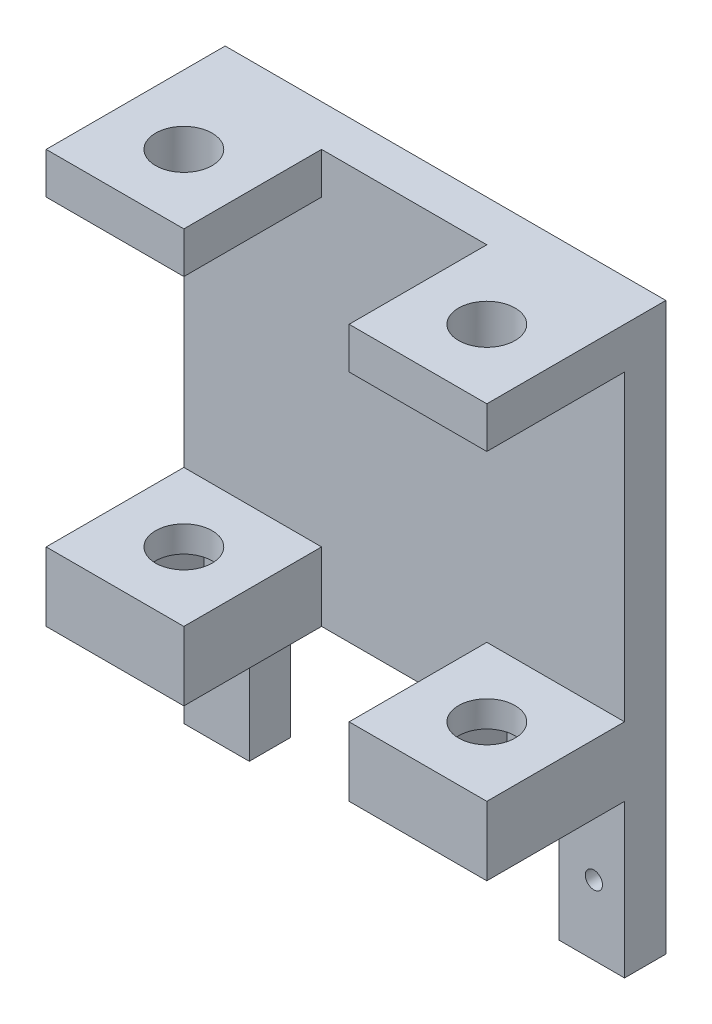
from build123d import *

# Parameters (mm, degrees)
SKETCH1_R             = 1.15
BOSS_EXTRUDE1_DEPTH   = 2.5
BOSS_EXTRUDE1_2_DEPTH = 2.5
BOSS_EXTRUDE1_3_DEPTH = 2.5
BOSS_EXTRUDE1_4_DEPTH = 2.5
BOSS_EXTRUDE1_5_DEPTH = 2.5
SKETCH2_W             = 32
SKETCH2_H             = 30
BOSS_EXTRUDE2_DEPTH   = 3
SKETCH3_W             = 10
SKETCH3_H             = 3
SKETCH3_H_2           = 5
BOSS_EXTRUDE3_DEPTH   = 10
SKETCH4_R             = 2.05
CUT_EXTRUDE1_DEPTH    = 38.366428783
CUT_EXTRUDE2_DEPTH    = 3.1
SKETCH7_W             = 4.75
SKETCH7_H             = 11.11
SKETCH7_R             = 0.625
BOSS_EXTRUDE4_DEPTH   = 3


with BuildPart() as part:
    # Sketch1 → Boss-Extrude1 (new body)
    with BuildSketch(Plane.XY):
        Circle(SKETCH1_R)
    extrude(amount=BOSS_EXTRUDE1_DEPTH)



with BuildPart() as body_2:
    # Sketch1 → Boss-Extrude1 2 (new body)
    with BuildSketch(Plane.XY):
        with Locations((2.5, 9.5)):
            Circle(SKETCH1_R)
    extrude(amount=BOSS_EXTRUDE1_2_DEPTH)


with BuildPart() as body_3:
    # Sketch1 → Boss-Extrude1 3 (new body)
    with BuildSketch(Plane.XY):
        with Locations((-2.5, 9.5)):
            Circle(SKETCH1_R)
    extrude(amount=BOSS_EXTRUDE1_3_DEPTH)


with BuildPart() as body_4:
    # Sketch1 → Boss-Extrude1 4 (new body)
    with BuildSketch(Plane.XY):
        with Locations((-2.5, -9.5)):
            Circle(SKETCH1_R)
    extrude(amount=BOSS_EXTRUDE1_4_DEPTH)


with BuildPart() as body_5:
    # Sketch1 → Boss-Extrude1 5 (new body)
    with BuildSketch(Plane.XY):
        with Locations((2.5, -9.5)):
            Circle(SKETCH1_R)
    extrude(amount=BOSS_EXTRUDE1_5_DEPTH)


with BuildPart() as part_1:
    add(part.part)

    add(body_2.part)  # Boss-Extrude2 merges body 2

    add(body_3.part)  # Boss-Extrude2 merges body 3

    add(body_4.part)  # Boss-Extrude2 merges body 4

    add(body_5.part)  # Boss-Extrude2 merges body 5
    # Sketch2 → Boss-Extrude2 (add)
    with BuildSketch(Plane.XY.offset(2.5)):
        Rectangle(SKETCH2_W, SKETCH2_H)
    extrude(amount=BOSS_EXTRUDE2_DEPTH)

    # Sketch3 → Boss-Extrude3 (add)
    with BuildSketch(Plane.XY.offset(5.5)):
        with Locations((-11, 13.5)):
            Rectangle(SKETCH3_W, SKETCH3_H)
        with Locations((11, 13.5)):
            Rectangle(SKETCH3_W, SKETCH3_H)
        with Locations((11, -12.5)):
            Rectangle(SKETCH3_W, SKETCH3_H_2)
        with Locations((-11, -12.5)):
            Rectangle(SKETCH3_W, SKETCH3_H_2)
    extrude(amount=BOSS_EXTRUDE3_DEPTH)

    # Sketch4 → Cut-Extrude1 (cut, through all)
    with BuildSketch(Plane(origin=(0, 15, 0), x_dir=(1, 0, 0), z_dir=(0, 1, 0))):
        with Locations(Location((11, -10.5, 0), (0, 0, 270))):
            Circle(SKETCH4_R)
        with Locations(Location((-11, -10.5, 0), (0, 0, 270))):
            Circle(SKETCH4_R)
    extrude(amount=-CUT_EXTRUDE1_DEPTH, mode=Mode.SUBTRACT)

    # Sketch6 → Cut-Extrude2 (cut)
    with BuildSketch(Plane.XZ.offset(15)):
        Polygon((-8.979274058, 7), (-6.958548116, 10.5), (-8.979274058, 14), (-13.020725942, 14), (-15.041451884, 10.5), (-13.020725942, 7), align=None)
        Polygon((13.020725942, 7), (15.041451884, 10.5), (13.020725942, 14), (8.979274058, 14), (6.958548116, 10.5), (8.979274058, 7), align=None)
    extrude(amount=-CUT_EXTRUDE2_DEPTH, mode=Mode.SUBTRACT)

    # Sketch7 → Boss-Extrude4 (add)
    # profile 1 of 2: a face of its own
    with BuildSketch(Plane.XY.offset(5.5)):
        with Locations((-13.625, -20.555)):
            Rectangle(SKETCH7_W, SKETCH7_H)
        with Locations((-13.775, -21.055)):
            Circle(SKETCH7_R, mode=Mode.SUBTRACT)
    # profile 2 of 2: a face of its own
    with BuildSketch(Plane.XY.offset(5.5)):
        with Locations((13.625, -20.555)):
            Rectangle(SKETCH7_W, SKETCH7_H)
        with Locations((13.775, -21.055)):
            Circle(SKETCH7_R, mode=Mode.SUBTRACT)
    extrude(amount=-BOSS_EXTRUDE4_DEPTH)


solid = part_1.part
